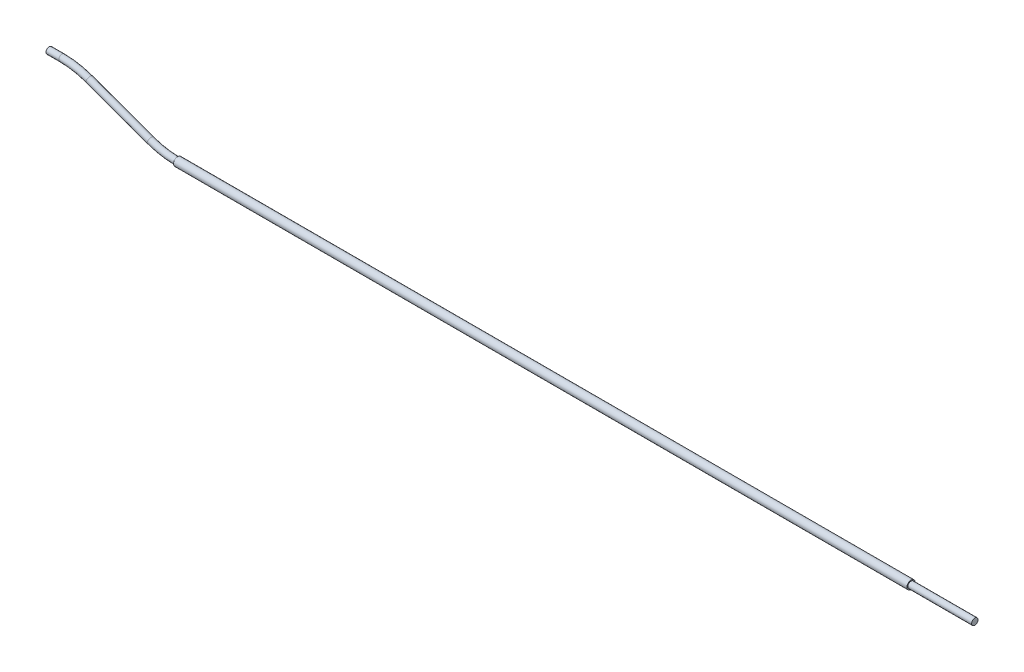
ISO-10303-21;
HEADER;
FILE_DESCRIPTION(('STEP AP214'),'2;1');
FILE_NAME('part.step','',(''),(''),'','','');
FILE_SCHEMA(('AUTOMOTIVE_DESIGN { 1 0 10303 214 1 1 1 1 }'));
ENDSEC;
DATA;
#1=APPLICATION_CONTEXT('core data for automotive mechanical design processes');
#2=APPLICATION_PROTOCOL_DEFINITION('international standard','automotive_design',2000,#1);
#3=PRODUCT_CONTEXT('',#1,'mechanical');
#4=PRODUCT('Part','Part','',(#3));
#5=PRODUCT_RELATED_PRODUCT_CATEGORY('part','',(#4));
#6=PRODUCT_DEFINITION_FORMATION('','',#4);
#7=PRODUCT_DEFINITION_CONTEXT('part definition',#1,'design');
#8=PRODUCT_DEFINITION('design','',#6,#7);
#9=PRODUCT_DEFINITION_SHAPE('','',#8);
#10=(LENGTH_UNIT() NAMED_UNIT(*) SI_UNIT(.MILLI.,.METRE.));
#11=(NAMED_UNIT(*) PLANE_ANGLE_UNIT() SI_UNIT($,.RADIAN.));
#12=(NAMED_UNIT(*) SI_UNIT($,.STERADIAN.) SOLID_ANGLE_UNIT());
#13=UNCERTAINTY_MEASURE_WITH_UNIT(LENGTH_MEASURE(1.E-05),#10,'distance_accuracy_value','');
#14=(GEOMETRIC_REPRESENTATION_CONTEXT(3) GLOBAL_UNCERTAINTY_ASSIGNED_CONTEXT((#13)) GLOBAL_UNIT_ASSIGNED_CONTEXT((#10,
#11,#12)) REPRESENTATION_CONTEXT('',''));
#15=CARTESIAN_POINT('',(0.,0.,0.));
#16=DIRECTION('',(0.,0.,1.));
#17=DIRECTION('',(1.,0.,0.));
#18=AXIS2_PLACEMENT_3D('',#15,#16,#17);
#19=CARTESIAN_POINT('',(-31.75,0.,0.));
#20=DIRECTION('',(1.,0.,0.));
#21=DIRECTION('',(0.,0.,-1.));
#22=AXIS2_PLACEMENT_3D('',#19,#20,#21);
#23=CYLINDRICAL_SURFACE('',#22,0.1651);
#24=CARTESIAN_POINT('',(-31.75,0.,0.));
#25=DIRECTION('',(1.,0.,0.));
#26=DIRECTION('',(0.,0.,-1.));
#27=AXIS2_PLACEMENT_3D('',#24,#25,#26);
#28=CIRCLE('',#27,0.1651);
#29=CARTESIAN_POINT('',(-31.75,0.,-0.1651));
#30=VERTEX_POINT('',#29);
#31=EDGE_CURVE('E11',#30,#30,#28,.T.);
#32=ORIENTED_EDGE('',*,*,#31,.T.);
#33=EDGE_LOOP('',(#32));
#34=FACE_BOUND('',#33,.T.);
#35=CARTESIAN_POINT('',(-2.54,0.,0.));
#36=DIRECTION('',(1.,0.,0.));
#37=DIRECTION('',(0.,0.,-1.));
#38=AXIS2_PLACEMENT_3D('',#35,#36,#37);
#39=CIRCLE('',#38,0.1651);
#40=CARTESIAN_POINT('',(-2.54,0.,-0.1651));
#41=VERTEX_POINT('',#40);
#42=EDGE_CURVE('E41',#41,#41,#39,.T.);
#43=ORIENTED_EDGE('',*,*,#42,.F.);
#44=EDGE_LOOP('',(#43));
#45=FACE_BOUND('',#44,.T.);
#46=ADVANCED_FACE('F38',(#34,#45),#23,.T.);
#47=CARTESIAN_POINT('',(-31.75,0.,0.));
#48=DIRECTION('',(1.,0.,0.));
#49=DIRECTION('',(0.,0.,-1.));
#50=AXIS2_PLACEMENT_3D('',#47,#48,#49);
#51=PLANE('',#50);
#52=CARTESIAN_POINT('',(-31.75,0.,0.));
#53=DIRECTION('',(1.,0.,0.));
#54=DIRECTION('',(0.,0.,-1.));
#55=AXIS2_PLACEMENT_3D('',#52,#53,#54);
#56=CIRCLE('',#55,0.127);
#57=CARTESIAN_POINT('',(-31.75,0.,-0.127));
#58=VERTEX_POINT('',#57);
#59=EDGE_CURVE('E48',#58,#58,#56,.T.);
#60=ORIENTED_EDGE('',*,*,#59,.T.);
#61=EDGE_LOOP('',(#60));
#62=FACE_BOUND('',#61,.T.);
#63=ORIENTED_EDGE('',*,*,#31,.F.);
#64=EDGE_LOOP('',(#63));
#65=FACE_BOUND('',#64,.T.);
#66=ADVANCED_FACE('F56',(#62,#65),#51,.F.);
#67=CARTESIAN_POINT('',(-2.54,0.,0.));
#68=DIRECTION('',(1.,0.,0.));
#69=DIRECTION('',(0.,0.,-1.));
#70=AXIS2_PLACEMENT_3D('',#67,#68,#69);
#71=PLANE('',#70);
#72=CARTESIAN_POINT('',(-2.54,0.,0.));
#73=DIRECTION('',(1.,0.,0.));
#74=DIRECTION('',(0.,0.,-1.));
#75=AXIS2_PLACEMENT_3D('',#72,#73,#74);
#76=CIRCLE('',#75,0.127);
#77=CARTESIAN_POINT('',(-2.54,0.,-0.127));
#78=VERTEX_POINT('',#77);
#79=EDGE_CURVE('E50',#78,#78,#76,.T.);
#80=ORIENTED_EDGE('',*,*,#79,.F.);
#81=EDGE_LOOP('',(#80));
#82=FACE_BOUND('',#81,.T.);
#83=ORIENTED_EDGE('',*,*,#42,.T.);
#84=EDGE_LOOP('',(#83));
#85=FACE_BOUND('',#84,.T.);
#86=ADVANCED_FACE('F62',(#82,#85),#71,.T.);
#87=CARTESIAN_POINT('',(-31.75,0.,0.));
#88=DIRECTION('',(1.,0.,0.));
#89=DIRECTION('',(0.,0.,-1.));
#90=AXIS2_PLACEMENT_3D('',#87,#88,#89);
#91=CYLINDRICAL_SURFACE('',#90,0.127);
#92=ORIENTED_EDGE('',*,*,#59,.F.);
#93=EDGE_LOOP('',(#92));
#94=FACE_BOUND('',#93,.T.);
#95=ORIENTED_EDGE('',*,*,#79,.T.);
#96=EDGE_LOOP('',(#95));
#97=FACE_BOUND('',#96,.T.);
#98=ADVANCED_FACE('F59',(#94,#97),#91,.F.);
#99=CLOSED_SHELL('',(#46,#66,#86,#98));
#100=MANIFOLD_SOLID_BREP('B2',#99);
#101=CARTESIAN_POINT('',(-36.3589726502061,-1.905,0.));
#102=DIRECTION('',(0.,0.,1.));
#103=DIRECTION('',(1.,0.,0.));
#104=AXIS2_PLACEMENT_3D('',#101,#102,#103);
#105=TOROIDAL_SURFACE('',#104,3.175,0.127);
#106=CARTESIAN_POINT('',(-35.2730586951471,1.07852407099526,0.));
#107=DIRECTION('',(0.939692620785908,-0.342020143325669,0.));
#108=DIRECTION('',(0.,0.,-1.));
#109=AXIS2_PLACEMENT_3D('',#106,#107,#108);
#110=CIRCLE('',#109,0.127);
#111=CARTESIAN_POINT('',(-35.2296221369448,1.19786503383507,0.));
#112=VERTEX_POINT('',#111);
#113=EDGE_CURVE('E37',#112,#112,#110,.T.);
#114=CARTESIAN_POINT('',(-36.3589726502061,1.27,0.));
#115=DIRECTION('',(-1.,0.,0.));
#116=DIRECTION('',(0.,-1.,0.));
#117=AXIS2_PLACEMENT_3D('',#114,#115,#116);
#118=CIRCLE('',#117,0.127);
#119=CARTESIAN_POINT('',(-36.3589726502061,1.397,0.));
#120=VERTEX_POINT('',#119);
#121=EDGE_CURVE('E119',#120,#120,#118,.T.);
#122=CARTESIAN_POINT('',(-36.3589726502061,-1.905,0.));
#123=DIRECTION('',(0.,0.,1.));
#124=DIRECTION('',(1.,0.,0.));
#125=AXIS2_PLACEMENT_3D('',#122,#123,#124);
#126=CIRCLE('',#125,3.302);
#127=EDGE_CURVE('',#112,#120,#126,.T.);
#128=ORIENTED_EDGE('',*,*,#113,.F.);
#129=ORIENTED_EDGE('',*,*,#121,.F.);
#130=ORIENTED_EDGE('',*,*,#127,.T.);
#131=ORIENTED_EDGE('',*,*,#127,.F.);
#132=EDGE_LOOP('',(#128,#130,#129,#131));
#133=FACE_BOUND('',#132,.T.);
#134=ADVANCED_FACE('F99',(#133),#105,.T.);
#135=CARTESIAN_POINT('',(-32.835913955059,0.191475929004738,0.));
#136=DIRECTION('',(-0.939692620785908,0.34202014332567,0.));
#137=DIRECTION('',(-0.34202014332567,-0.939692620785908,0.));
#138=AXIS2_PLACEMENT_3D('',#135,#136,#137);
#139=CYLINDRICAL_SURFACE('',#138,0.127);
#140=CARTESIAN_POINT('',(-32.835913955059,0.191475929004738,0.));
#141=DIRECTION('',(0.939692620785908,-0.342020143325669,0.));
#142=DIRECTION('',(0.,0.,-1.));
#143=AXIS2_PLACEMENT_3D('',#140,#141,#142);
#144=CIRCLE('',#143,0.127);
#145=CARTESIAN_POINT('',(-32.8793505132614,0.0721349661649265,0.));
#146=VERTEX_POINT('',#145);
#147=EDGE_CURVE('E105',#146,#146,#144,.T.);
#148=ORIENTED_EDGE('',*,*,#147,.F.);
#149=EDGE_LOOP('',(#148));
#150=FACE_BOUND('',#149,.T.);
#151=ORIENTED_EDGE('',*,*,#113,.T.);
#152=EDGE_LOOP('',(#151));
#153=FACE_BOUND('',#152,.T.);
#154=ADVANCED_FACE('F135',(#150,#153),#139,.T.);
#155=CARTESIAN_POINT('',(-31.75,3.175,0.));
#156=DIRECTION('',(0.,0.,-1.));
#157=DIRECTION('',(-1.,0.,0.));
#158=AXIS2_PLACEMENT_3D('',#155,#156,#157);
#159=TOROIDAL_SURFACE('',#158,3.175,0.127);
#160=CARTESIAN_POINT('',(-31.75,0.,0.));
#161=DIRECTION('',(1.,0.,0.));
#162=DIRECTION('',(0.,0.,-1.));
#163=AXIS2_PLACEMENT_3D('',#160,#161,#162);
#164=CIRCLE('',#163,0.127);
#165=CARTESIAN_POINT('',(-31.75,-0.127000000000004,0.));
#166=VERTEX_POINT('',#165);
#167=EDGE_CURVE('E109',#166,#166,#164,.T.);
#168=CARTESIAN_POINT('',(-31.75,3.175,0.));
#169=DIRECTION('',(0.,0.,-1.));
#170=DIRECTION('',(-1.,0.,0.));
#171=AXIS2_PLACEMENT_3D('',#168,#169,#170);
#172=CIRCLE('',#171,3.302);
#173=EDGE_CURVE('',#166,#146,#172,.T.);
#174=ORIENTED_EDGE('',*,*,#167,.F.);
#175=ORIENTED_EDGE('',*,*,#147,.T.);
#176=ORIENTED_EDGE('',*,*,#173,.T.);
#177=ORIENTED_EDGE('',*,*,#173,.F.);
#178=EDGE_LOOP('',(#174,#176,#175,#177));
#179=FACE_BOUND('',#178,.T.);
#180=ADVANCED_FACE('F140',(#179),#159,.T.);
#181=CARTESIAN_POINT('',(-31.75,0.,0.));
#182=DIRECTION('',(1.,0.,0.));
#183=DIRECTION('',(0.,1.,0.));
#184=AXIS2_PLACEMENT_3D('',#181,#182,#183);
#185=CYLINDRICAL_SURFACE('',#184,0.127);
#186=ORIENTED_EDGE('',*,*,#167,.T.);
#187=EDGE_LOOP('',(#186));
#188=FACE_BOUND('',#187,.T.);
#189=CARTESIAN_POINT('',(0.,0.,0.));
#190=DIRECTION('',(1.,0.,0.));
#191=DIRECTION('',(0.,0.,-1.));
#192=AXIS2_PLACEMENT_3D('',#189,#190,#191);
#193=CIRCLE('',#192,0.127);
#194=CARTESIAN_POINT('',(0.,0.,-0.127));
#195=VERTEX_POINT('',#194);
#196=EDGE_CURVE('E113',#195,#195,#193,.T.);
#197=ORIENTED_EDGE('',*,*,#196,.F.);
#198=EDGE_LOOP('',(#197));
#199=FACE_BOUND('',#198,.T.);
#200=ADVANCED_FACE('F145',(#188,#199),#185,.T.);
#201=CARTESIAN_POINT('',(0.,0.,0.));
#202=DIRECTION('',(1.,0.,0.));
#203=DIRECTION('',(0.,0.,-1.));
#204=AXIS2_PLACEMENT_3D('',#201,#202,#203);
#205=PLANE('',#204);
#206=ORIENTED_EDGE('',*,*,#196,.T.);
#207=EDGE_LOOP('',(#206));
#208=FACE_BOUND('',#207,.T.);
#209=ADVANCED_FACE('F130',(#208),#205,.T.);
#210=CARTESIAN_POINT('',(-36.8669726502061,1.27,0.));
#211=DIRECTION('',(1.,0.,0.));
#212=DIRECTION('',(0.,1.,0.));
#213=AXIS2_PLACEMENT_3D('',#210,#211,#212);
#214=CYLINDRICAL_SURFACE('',#213,0.127);
#215=CARTESIAN_POINT('',(-36.8669726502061,1.27,0.));
#216=DIRECTION('',(-1.,0.,0.));
#217=DIRECTION('',(0.,-1.,0.));
#218=AXIS2_PLACEMENT_3D('',#215,#216,#217);
#219=CIRCLE('',#218,0.127);
#220=CARTESIAN_POINT('',(-36.8669726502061,1.143,0.));
#221=VERTEX_POINT('',#220);
#222=EDGE_CURVE('E117',#221,#221,#219,.T.);
#223=ORIENTED_EDGE('',*,*,#222,.F.);
#224=EDGE_LOOP('',(#223));
#225=FACE_BOUND('',#224,.T.);
#226=ORIENTED_EDGE('',*,*,#121,.T.);
#227=EDGE_LOOP('',(#226));
#228=FACE_BOUND('',#227,.T.);
#229=ADVANCED_FACE('F127',(#225,#228),#214,.T.);
#230=CARTESIAN_POINT('',(-36.8669726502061,1.27,0.));
#231=DIRECTION('',(-1.,0.,0.));
#232=DIRECTION('',(0.,-1.,0.));
#233=AXIS2_PLACEMENT_3D('',#230,#231,#232);
#234=PLANE('',#233);
#235=ORIENTED_EDGE('',*,*,#222,.T.);
#236=EDGE_LOOP('',(#235));
#237=FACE_BOUND('',#236,.T.);
#238=ADVANCED_FACE('F125',(#237),#234,.T.);
#239=CLOSED_SHELL('',(#134,#154,#180,#200,#209,#229,#238));
#240=MANIFOLD_SOLID_BREP('B6',#239);
#241=ADVANCED_BREP_SHAPE_REPRESENTATION('',(#18,#100,#240),#14);
#242=SHAPE_DEFINITION_REPRESENTATION(#9,#241);
ENDSEC;
END-ISO-10303-21;
